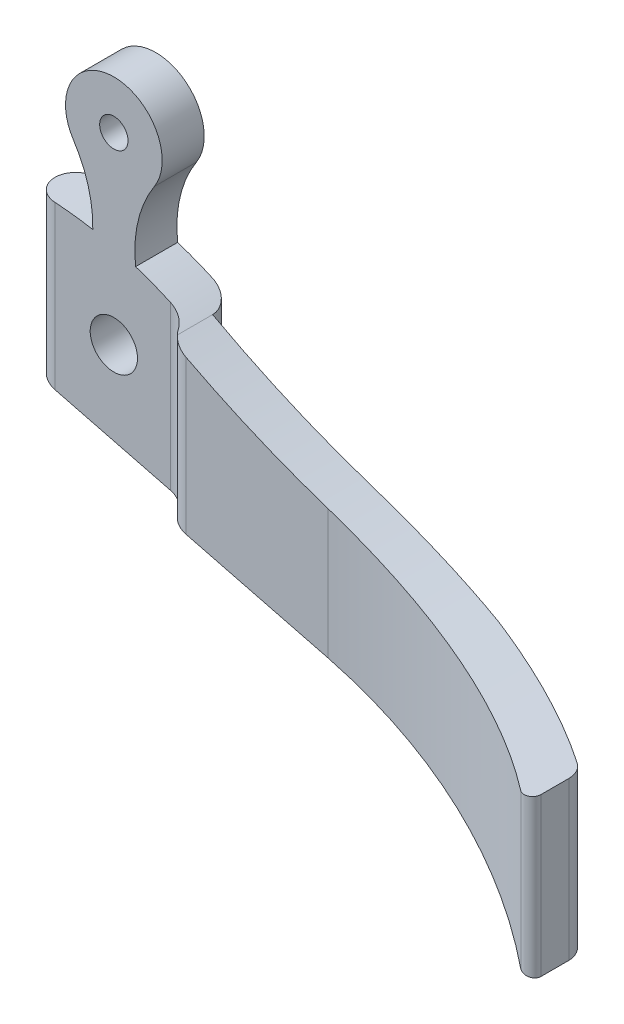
ISO-10303-21;
HEADER;
FILE_DESCRIPTION(('STEP AP214'),'2;1');
FILE_NAME('part.step','',(''),(''),'','','');
FILE_SCHEMA(('AUTOMOTIVE_DESIGN { 1 0 10303 214 1 1 1 1 }'));
ENDSEC;
DATA;
#1=APPLICATION_CONTEXT('core data for automotive mechanical design processes');
#2=APPLICATION_PROTOCOL_DEFINITION('international standard','automotive_design',2000,#1);
#3=PRODUCT_CONTEXT('',#1,'mechanical');
#4=PRODUCT('Part','Part','',(#3));
#5=PRODUCT_RELATED_PRODUCT_CATEGORY('part','',(#4));
#6=PRODUCT_DEFINITION_FORMATION('','',#4);
#7=PRODUCT_DEFINITION_CONTEXT('part definition',#1,'design');
#8=PRODUCT_DEFINITION('design','',#6,#7);
#9=PRODUCT_DEFINITION_SHAPE('','',#8);
#10=(LENGTH_UNIT() NAMED_UNIT(*) SI_UNIT(.MILLI.,.METRE.));
#11=(NAMED_UNIT(*) PLANE_ANGLE_UNIT() SI_UNIT($,.RADIAN.));
#12=(NAMED_UNIT(*) SI_UNIT($,.STERADIAN.) SOLID_ANGLE_UNIT());
#13=UNCERTAINTY_MEASURE_WITH_UNIT(LENGTH_MEASURE(1.E-05),#10,'distance_accuracy_value','');
#14=(GEOMETRIC_REPRESENTATION_CONTEXT(3) GLOBAL_UNCERTAINTY_ASSIGNED_CONTEXT((#13)) GLOBAL_UNIT_ASSIGNED_CONTEXT((#10,
#11,#12)) REPRESENTATION_CONTEXT('',''));
#15=CARTESIAN_POINT('',(0.,0.,0.));
#16=DIRECTION('',(0.,0.,1.));
#17=DIRECTION('',(1.,0.,0.));
#18=AXIS2_PLACEMENT_3D('',#15,#16,#17);
#19=CARTESIAN_POINT('',(0.,19.05,17.5519263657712));
#20=DIRECTION('',(0.246398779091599,0.969168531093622,0.));
#21=DIRECTION('',(-0.969168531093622,0.246398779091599,0.));
#22=AXIS2_PLACEMENT_3D('',#19,#20,#21);
#23=PLANE('',#22);
#24=CARTESIAN_POINT('',(37.9327961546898,9.40606877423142,60.9597607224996));
#25=DIRECTION('',(0.246398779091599,0.969168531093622,0.));
#26=DIRECTION('',(0.969168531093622,-0.246398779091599,0.));
#27=AXIS2_PLACEMENT_3D('',#24,#25,#26);
#28=ELLIPSE('',#27,65.8701395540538,63.8392663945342);
#29=CARTESIAN_POINT('',(73.81777072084,0.282770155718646,8.16089203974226));
#30=VERTEX_POINT('',#29);
#31=CARTESIAN_POINT('',(55.88,4.84322033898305,-0.304827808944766));
#32=VERTEX_POINT('',#31);
#33=EDGE_CURVE('E171',#30,#32,#28,.T.);
#34=ORIENTED_EDGE('',*,*,#33,.F.);
#35=CARTESIAN_POINT('',(72.39,0.645762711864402,10.2616230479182));
#36=DIRECTION('',(0.246398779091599,0.969168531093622,0.));
#37=DIRECTION('',(0.969168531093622,-0.246398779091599,0.));
#38=AXIS2_PLACEMENT_3D('',#35,#36,#37);
#39=ELLIPSE('',#38,2.62080321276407,2.54);
#40=CARTESIAN_POINT('',(74.93,0.,10.2616230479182));
#41=VERTEX_POINT('',#40);
#42=EDGE_CURVE('E60',#30,#41,#39,.F.);
#43=ORIENTED_EDGE('',*,*,#42,.T.);
#44=DIRECTION('',(0.,0.,1.));
#45=VECTOR('',#44,1.);
#46=CARTESIAN_POINT('',(74.93,0.,10.16));
#47=LINE('',#46,#45);
#48=CARTESIAN_POINT('',(74.93,0.,13.6523504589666));
#49=VERTEX_POINT('',#48);
#50=EDGE_CURVE('E190',#41,#49,#47,.T.);
#51=ORIENTED_EDGE('',*,*,#50,.T.);
#52=CARTESIAN_POINT('',(73.914,0.258305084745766,13.6523504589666));
#53=DIRECTION('',(-0.246398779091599,-0.969168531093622,0.));
#54=DIRECTION('',(0.969168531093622,-0.246398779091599,0.));
#55=AXIS2_PLACEMENT_3D('',#52,#53,#54);
#56=ELLIPSE('',#55,1.04832128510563,1.016);
#57=CARTESIAN_POINT('',(73.2989366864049,0.414677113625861,14.4610241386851));
#58=VERTEX_POINT('',#57);
#59=EDGE_CURVE('E453',#58,#49,#56,.F.);
#60=ORIENTED_EDGE('',*,*,#59,.F.);
#61=CARTESIAN_POINT('',(37.9327961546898,9.40606877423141,60.9597607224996));
#62=DIRECTION('',(-0.246398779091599,-0.969168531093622,0.));
#63=DIRECTION('',(0.969168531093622,-0.246398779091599,0.));
#64=AXIS2_PLACEMENT_3D('',#61,#62,#63);
#65=ELLIPSE('',#64,60.2784738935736,58.42);
#66=CARTESIAN_POINT('',(38.1,9.36355932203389,2.54));
#67=VERTEX_POINT('',#66);
#68=EDGE_CURVE('E201',#58,#67,#65,.F.);
#69=ORIENTED_EDGE('',*,*,#68,.T.);
#70=DIRECTION('',(-0.969168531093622,0.246398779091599,0.));
#71=VECTOR('',#70,1.);
#72=CARTESIAN_POINT('',(13.3440137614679,15.6574541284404,2.54));
#73=LINE('',#72,#71);
#74=CARTESIAN_POINT('',(20.909409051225,13.7340485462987,2.54));
#75=VERTEX_POINT('',#74);
#76=EDGE_CURVE('E196',#67,#75,#73,.T.);
#77=ORIENTED_EDGE('',*,*,#76,.T.);
#78=CARTESIAN_POINT('',(20.909409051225,13.7340485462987,0.));
#79=DIRECTION('',(0.246398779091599,0.969168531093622,0.));
#80=DIRECTION('',(-0.969168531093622,0.246398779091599,0.));
#81=AXIS2_PLACEMENT_3D('',#78,#79,#80);
#82=ELLIPSE('',#81,2.62080321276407,2.54);
#83=CARTESIAN_POINT('',(18.7097045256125,14.2932954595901,1.27));
#84=VERTEX_POINT('',#83);
#85=EDGE_CURVE('E502',#75,#84,#82,.F.);
#86=ORIENTED_EDGE('',*,*,#85,.T.);
#87=CARTESIAN_POINT('',(16.51,14.8525423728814,2.54));
#88=DIRECTION('',(0.246398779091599,0.969168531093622,0.));
#89=DIRECTION('',(-0.969168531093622,0.246398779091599,0.));
#90=AXIS2_PLACEMENT_3D('',#87,#88,#89);
#91=ELLIPSE('',#90,2.62080321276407,2.54);
#92=CARTESIAN_POINT('',(16.51,14.8525423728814,0.));
#93=VERTEX_POINT('',#92);
#94=EDGE_CURVE('E275',#84,#93,#91,.T.);
#95=ORIENTED_EDGE('',*,*,#94,.T.);
#96=DIRECTION('',(0.969168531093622,-0.246398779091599,0.));
#97=VECTOR('',#96,1.);
#98=CARTESIAN_POINT('',(0.,19.05,0.));
#99=LINE('',#98,#97);
#100=CARTESIAN_POINT('',(2.54,18.4042372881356,0.));
#101=VERTEX_POINT('',#100);
#102=EDGE_CURVE('E455',#101,#93,#99,.T.);
#103=ORIENTED_EDGE('',*,*,#102,.F.);
#104=CARTESIAN_POINT('',(2.54,18.4042372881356,-2.54));
#105=DIRECTION('',(0.246398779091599,0.969168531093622,0.));
#106=DIRECTION('',(0.969168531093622,-0.246398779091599,0.));
#107=AXIS2_PLACEMENT_3D('',#104,#105,#106);
#108=ELLIPSE('',#107,2.62080321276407,2.54);
#109=CARTESIAN_POINT('',(0.,19.05,-2.54));
#110=VERTEX_POINT('',#109);
#111=EDGE_CURVE('E497',#101,#110,#108,.F.);
#112=ORIENTED_EDGE('',*,*,#111,.T.);
#113=CARTESIAN_POINT('',(2.54,18.4042372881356,-2.54));
#114=DIRECTION('',(-0.246398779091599,-0.969168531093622,0.));
#115=DIRECTION('',(0.969168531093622,-0.246398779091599,0.));
#116=AXIS2_PLACEMENT_3D('',#113,#114,#115);
#117=ELLIPSE('',#116,2.62080321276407,2.54);
#118=CARTESIAN_POINT('',(2.54,18.4042372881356,-5.08));
#119=VERTEX_POINT('',#118);
#120=EDGE_CURVE('E462',#110,#119,#117,.T.);
#121=ORIENTED_EDGE('',*,*,#120,.T.);
#122=DIRECTION('',(-0.969168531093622,0.246398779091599,0.));
#123=VECTOR('',#122,1.);
#124=CARTESIAN_POINT('',(0.,19.05,-5.08));
#125=LINE('',#124,#123);
#126=CARTESIAN_POINT('',(16.51,14.8525423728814,-5.08));
#127=VERTEX_POINT('',#126);
#128=EDGE_CURVE('E454',#127,#119,#125,.T.);
#129=ORIENTED_EDGE('',*,*,#128,.F.);
#130=CARTESIAN_POINT('',(16.5099999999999,14.8525423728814,-2.53999999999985));
#131=DIRECTION('',(-0.246398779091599,-0.969168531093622,0.));
#132=DIRECTION('',(0.969168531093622,-0.246398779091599,0.));
#133=AXIS2_PLACEMENT_3D('',#130,#131,#132);
#134=ELLIPSE('',#133,2.62080321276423,2.54000000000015);
#135=CARTESIAN_POINT('',(19.05,14.206779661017,-2.54000000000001));
#136=VERTEX_POINT('',#135);
#137=EDGE_CURVE('E460',#127,#136,#134,.T.);
#138=ORIENTED_EDGE('',*,*,#137,.T.);
#139=DIRECTION('',(0.969168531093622,-0.246398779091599,0.));
#140=VECTOR('',#139,1.);
#141=CARTESIAN_POINT('',(13.3442525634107,15.657393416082,-2.54));
#142=LINE('',#141,#140);
#143=CARTESIAN_POINT('',(38.1,9.3635593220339,-2.54));
#144=VERTEX_POINT('',#143);
#145=EDGE_CURVE('E195',#136,#144,#142,.T.);
#146=ORIENTED_EDGE('',*,*,#145,.T.);
#147=CARTESIAN_POINT('',(38.1,9.3635593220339,69.294375));
#148=DIRECTION('',(-0.246398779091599,-0.969168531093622,0.));
#149=DIRECTION('',(0.969168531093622,-0.246398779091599,0.));
#150=AXIS2_PLACEMENT_3D('',#147,#148,#149);
#151=ELLIPSE('',#150,74.1195908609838,71.834375);
#152=EDGE_CURVE('E186',#144,#32,#151,.T.);
#153=ORIENTED_EDGE('',*,*,#152,.T.);
#154=EDGE_LOOP('',(#34,#43,#51,#60,#69,#77,#86,#95,#103,#112,#121,#129,#138,#146,#153));
#155=FACE_BOUND('',#154,.T.);
#156=ADVANCED_FACE('F33',(#155),#23,.F.);
#157=CARTESIAN_POINT('',(74.93,38.1,10.16));
#158=DIRECTION('',(-1.,0.,0.));
#159=DIRECTION('',(0.,0.,-1.));
#160=AXIS2_PLACEMENT_3D('',#157,#158,#159);
#161=PLANE('',#160);
#162=ORIENTED_EDGE('',*,*,#50,.F.);
#163=DIRECTION('',(0.,1.,0.));
#164=VECTOR('',#163,1.);
#165=CARTESIAN_POINT('',(74.93,19.05,10.2616230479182));
#166=LINE('',#165,#164);
#167=CARTESIAN_POINT('',(74.93,19.05,10.2616230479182));
#168=VERTEX_POINT('',#167);
#169=EDGE_CURVE('E46',#41,#168,#166,.T.);
#170=ORIENTED_EDGE('',*,*,#169,.T.);
#171=DIRECTION('',(0.,0.,-1.));
#172=VECTOR('',#171,1.);
#173=CARTESIAN_POINT('',(74.93,19.05,10.16));
#174=LINE('',#173,#172);
#175=CARTESIAN_POINT('',(74.93,19.05,13.6523504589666));
#176=VERTEX_POINT('',#175);
#177=EDGE_CURVE('E358',#176,#168,#174,.T.);
#178=ORIENTED_EDGE('',*,*,#177,.F.);
#179=DIRECTION('',(0.,-1.,0.));
#180=VECTOR('',#179,1.);
#181=CARTESIAN_POINT('',(74.93,38.1,13.6523504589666));
#182=LINE('',#181,#180);
#183=EDGE_CURVE('E387',#49,#176,#182,.F.);
#184=ORIENTED_EDGE('',*,*,#183,.F.);
#185=EDGE_LOOP('',(#162,#170,#178,#184));
#186=FACE_BOUND('',#185,.T.);
#187=ADVANCED_FACE('F336',(#186),#161,.F.);
#188=CARTESIAN_POINT('',(74.93,136.050723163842,10.16));
#189=DIRECTION('',(0.,0.,-1.));
#190=DIRECTION('',(1.,0.,0.));
#191=AXIS2_PLACEMENT_3D('',#188,#189,#190);
#192=CYLINDRICAL_SURFACE('',#191,117.000723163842);
#193=ORIENTED_EDGE('',*,*,#177,.T.);
#194=CARTESIAN_POINT('',(74.93,19.05,10.2616230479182));
#195=CARTESIAN_POINT('',(74.930006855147,19.0500004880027,10.1901645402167));
#196=CARTESIAN_POINT('',(74.9269844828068,19.0500000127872,10.1187092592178));
#197=CARTESIAN_POINT('',(74.9149342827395,19.0500006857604,9.97630978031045));
#198=CARTESIAN_POINT('',(74.9059067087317,19.0500018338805,9.9053655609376));
#199=CARTESIAN_POINT('',(74.8819140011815,19.0500092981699,9.76457417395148));
#200=CARTESIAN_POINT('',(74.8669562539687,19.0500156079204,9.69472575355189));
#201=CARTESIAN_POINT('',(74.8312245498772,19.0500403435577,9.55655431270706));
#202=CARTESIAN_POINT('',(74.8104507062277,19.0500587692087,9.48823126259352));
#203=CARTESIAN_POINT('',(74.7395585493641,19.0501452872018,9.28616841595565));
#204=CARTESIAN_POINT('',(74.6808670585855,19.0502446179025,9.15532002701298));
#205=CARTESIAN_POINT('',(74.5423943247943,19.0506216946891,8.90544190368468));
#206=CARTESIAN_POINT('',(74.4626188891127,19.0508993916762,8.7864089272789));
#207=CARTESIAN_POINT('',(74.2943160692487,19.0517002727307,8.57603765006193));
#208=CARTESIAN_POINT('',(74.2078031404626,19.052192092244,8.48308958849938));
#209=CARTESIAN_POINT('',(74.0684294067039,19.0531630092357,8.35413836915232));
#210=CARTESIAN_POINT('',(74.0203391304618,19.0535257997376,8.31287823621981));
#211=CARTESIAN_POINT('',(73.9212067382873,19.0543385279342,8.23405955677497));
#212=CARTESIAN_POINT('',(73.8701642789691,19.054788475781,8.19650144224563));
#213=CARTESIAN_POINT('',(73.81777072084,19.0552866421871,8.16089203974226));
#214=B_SPLINE_CURVE_WITH_KNOTS('',3,(#194,#195,#196,#197,#198,#199,#200,#201,#202,#203,#204,
#205,#206,#207,#208,#209,#210,#211,#212,#213),.UNSPECIFIED.,.F.,.F.,(4,2,2,2,2,2,2,2,2,4),(0.,
0.214305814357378,0.428602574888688,0.642633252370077,0.856659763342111,1.28466801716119,
1.71255850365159,2.09198828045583,2.28193051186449,2.4718948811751),.UNSPECIFIED.);
#215=CARTESIAN_POINT('',(73.81777072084,19.0552866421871,8.16089203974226));
#216=VERTEX_POINT('',#215);
#217=EDGE_CURVE('E12',#168,#216,#214,.T.);
#218=ORIENTED_EDGE('',*,*,#217,.T.);
#219=CARTESIAN_POINT('',(74.93,19.05,8.93420122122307));
#220=CARTESIAN_POINT('',(74.2020518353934,19.0499871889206,8.41650692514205));
#221=CARTESIAN_POINT('',(73.4631995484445,19.0567931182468,7.9141124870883));
#222=CARTESIAN_POINT('',(71.9652416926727,19.0851734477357,6.94085934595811));
#223=CARTESIAN_POINT('',(71.2061352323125,19.1067484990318,6.47000203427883));
#224=CARTESIAN_POINT('',(69.6757435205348,19.1655502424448,5.56462378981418));
#225=CARTESIAN_POINT('',(68.9046141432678,19.2026439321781,5.12983084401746));
#226=CARTESIAN_POINT('',(67.3457203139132,19.2934645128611,4.2930655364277));
#227=CARTESIAN_POINT('',(66.5579561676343,19.3471910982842,3.89109257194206));
#228=CARTESIAN_POINT('',(64.9674836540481,19.472192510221,3.12068714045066));
#229=CARTESIAN_POINT('',(64.1647742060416,19.5434686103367,2.7522571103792));
#230=CARTESIAN_POINT('',(62.5463152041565,19.7043652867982,2.0496176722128));
#231=CARTESIAN_POINT('',(61.7305655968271,19.793985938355,1.71540840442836));
#232=CARTESIAN_POINT('',(60.0810041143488,19.9930990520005,1.07907391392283));
#233=CARTESIAN_POINT('',(59.2470978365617,20.102753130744,0.777243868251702));
#234=CARTESIAN_POINT('',(57.5699980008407,20.341957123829,0.20931228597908));
#235=CARTESIAN_POINT('',(56.7268041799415,20.4715076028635,-0.0567882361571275));
#236=CARTESIAN_POINT('',(55.88,20.6112727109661,-0.304827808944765));
#237=B_SPLINE_CURVE_WITH_KNOTS('',3,(#219,#220,#221,#222,#223,#224,#225,#226,#227,#228,#229,
#230,#231,#232,#233,#234,#235,#236),.UNSPECIFIED.,.F.,.F.,(4,2,2,2,2,2,2,2,4),(0.,
2.67959027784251,5.35929869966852,8.01649652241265,10.6736455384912,13.3309874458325,
15.988340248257,18.6681620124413,21.3480598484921),.UNSPECIFIED.);
#238=CARTESIAN_POINT('',(55.88,20.6112727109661,-0.304827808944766));
#239=VERTEX_POINT('',#238);
#240=EDGE_CURVE('E300',#216,#239,#237,.T.);
#241=ORIENTED_EDGE('',*,*,#240,.T.);
#242=CARTESIAN_POINT('',(38.1,24.9979414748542,-2.54));
#243=CARTESIAN_POINT('',(38.8341376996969,24.7544574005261,-2.54000917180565));
#244=CARTESIAN_POINT('',(39.5707086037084,24.5182697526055,-2.52874604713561));
#245=CARTESIAN_POINT('',(41.0477625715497,24.0607222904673,-2.48329378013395));
#246=CARTESIAN_POINT('',(41.7882457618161,23.8393629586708,-2.44910389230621));
#247=CARTESIAN_POINT('',(43.2681800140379,23.4128590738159,-2.35766020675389));
#248=CARTESIAN_POINT('',(44.00761565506,23.2076346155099,-2.30052992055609));
#249=CARTESIAN_POINT('',(45.4883390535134,22.8122801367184,-2.16290396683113));
#250=CARTESIAN_POINT('',(46.2296267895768,22.6221499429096,-2.08240856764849));
#251=CARTESIAN_POINT('',(47.7130450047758,22.2570939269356,-1.89779781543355));
#252=CARTESIAN_POINT('',(48.4551755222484,22.082168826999,-1.79368134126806));
#253=CARTESIAN_POINT('',(49.9391616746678,21.7475919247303,-1.56164610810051));
#254=CARTESIAN_POINT('',(50.6810173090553,21.587940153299,-1.43372730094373));
#255=CARTESIAN_POINT('',(52.1673001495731,21.2831011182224,-1.15321790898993));
#256=CARTESIAN_POINT('',(52.9117199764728,21.1379955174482,-1.00049941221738));
#257=CARTESIAN_POINT('',(54.398038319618,20.863138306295,-0.670839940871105));
#258=CARTESIAN_POINT('',(55.1399367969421,20.7333869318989,-0.4938985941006));
#259=CARTESIAN_POINT('',(55.88,20.6112727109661,-0.304827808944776));
#260=B_SPLINE_CURVE_WITH_KNOTS('',3,(#242,#243,#244,#245,#246,#247,#248,#249,#250,#251,#252,
#253,#254,#255,#256,#257,#258,#259),.UNSPECIFIED.,.F.,.F.,(4,2,2,2,2,2,2,2,4),(0.,
2.32028298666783,4.64064142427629,6.94867101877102,9.25667410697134,11.5647867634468,
13.8729040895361,16.1933281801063,18.5137879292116),.UNSPECIFIED.);
#261=CARTESIAN_POINT('',(38.1,24.9979414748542,-2.54));
#262=VERTEX_POINT('',#261);
#263=EDGE_CURVE('E189',#262,#239,#260,.T.);
#264=ORIENTED_EDGE('',*,*,#263,.F.);
#265=CARTESIAN_POINT('',(74.93,136.050723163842,-2.54));
#266=DIRECTION('',(0.,0.,-1.));
#267=DIRECTION('',(-1.,0.,0.));
#268=AXIS2_PLACEMENT_3D('',#265,#266,#267);
#269=CIRCLE('',#268,117.000723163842);
#270=CARTESIAN_POINT('',(19.05,33.2567796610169,-2.54));
#271=VERTEX_POINT('',#270);
#272=EDGE_CURVE('E356',#271,#262,#269,.F.);
#273=ORIENTED_EDGE('',*,*,#272,.F.);
#274=DIRECTION('',(0.,0.,-1.));
#275=VECTOR('',#274,1.);
#276=CARTESIAN_POINT('',(19.05,33.2567796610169,10.16));
#277=LINE('',#276,#275);
#278=CARTESIAN_POINT('',(19.05,33.2567796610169,1.73037509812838));
#279=VERTEX_POINT('',#278);
#280=EDGE_CURVE('E357',#279,#271,#277,.T.);
#281=ORIENTED_EDGE('',*,*,#280,.F.);
#282=CARTESIAN_POINT('',(19.05,33.2567796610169,1.73037509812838));
#283=CARTESIAN_POINT('',(19.103011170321,33.2279619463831,1.78733454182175));
#284=CARTESIAN_POINT('',(19.1582933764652,33.1979633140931,1.8414938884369));
#285=CARTESIAN_POINT('',(19.272863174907,33.1359206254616,1.944024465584));
#286=CARTESIAN_POINT('',(19.332148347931,33.1038778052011,1.99239914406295));
#287=CARTESIAN_POINT('',(19.5149878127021,33.0052734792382,2.1284268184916));
#288=CARTESIAN_POINT('',(19.6438056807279,32.9360838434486,2.20727979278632));
#289=CARTESIAN_POINT('',(19.9107956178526,32.7933781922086,2.34021645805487));
#290=CARTESIAN_POINT('',(20.0489471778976,32.7198717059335,2.39435255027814));
#291=CARTESIAN_POINT('',(20.3312609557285,32.5704239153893,2.47769029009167));
#292=CARTESIAN_POINT('',(20.4754180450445,32.4944847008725,2.50691277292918));
#293=CARTESIAN_POINT('',(20.6686731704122,32.3932072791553,2.52902857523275));
#294=CARTESIAN_POINT('',(20.7167701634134,32.3680442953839,2.53314508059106));
#295=CARTESIAN_POINT('',(20.8130361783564,32.3177661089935,2.53862701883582));
#296=CARTESIAN_POINT('',(20.8612049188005,32.2926509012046,2.53999734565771));
#297=CARTESIAN_POINT('',(20.909409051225,32.2675599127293,2.54));
#298=B_SPLINE_CURVE_WITH_KNOTS('',3,(#282,#283,#284,#285,#286,#287,#288,#289,#290,#291,#292,
#293,#294,#295,#296,#297),.UNSPECIFIED.,.F.,.F.,(4,2,2,2,2,2,2,4),(0.,0.248732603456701,
0.497316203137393,0.993196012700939,1.48801958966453,1.98242893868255,2.1456924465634,
2.3086647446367),.UNSPECIFIED.);
#299=CARTESIAN_POINT('',(20.909409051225,32.2675599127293,2.54));
#300=VERTEX_POINT('',#299);
#301=EDGE_CURVE('E295',#279,#300,#298,.T.);
#302=ORIENTED_EDGE('',*,*,#301,.T.);
#303=CARTESIAN_POINT('',(74.93,136.050723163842,2.54));
#304=DIRECTION('',(0.,0.,1.));
#305=DIRECTION('',(1.,0.,0.));
#306=AXIS2_PLACEMENT_3D('',#303,#304,#305);
#307=CIRCLE('',#306,117.000723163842);
#308=CARTESIAN_POINT('',(38.1,24.9979414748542,2.54));
#309=VERTEX_POINT('',#308);
#310=EDGE_CURVE('E205',#309,#300,#307,.F.);
#311=ORIENTED_EDGE('',*,*,#310,.F.);
#312=CARTESIAN_POINT('',(74.93,19.05,15.748));
#313=CARTESIAN_POINT('',(74.3415561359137,19.0499940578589,15.2664553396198));
#314=CARTESIAN_POINT('',(73.7436882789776,19.0544390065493,14.7964110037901));
#315=CARTESIAN_POINT('',(72.5301439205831,19.0730423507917,13.8800658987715));
#316=CARTESIAN_POINT('',(71.9144668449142,19.0872010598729,13.4337658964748));
#317=CARTESIAN_POINT('',(70.6662483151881,19.1260478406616,12.5655909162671));
#318=CARTESIAN_POINT('',(70.0337032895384,19.1507381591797,12.143721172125));
#319=CARTESIAN_POINT('',(68.7530235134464,19.2114100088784,11.325221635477));
#320=CARTESIAN_POINT('',(68.104888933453,19.2473914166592,10.928591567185));
#321=CARTESIAN_POINT('',(66.7940351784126,19.3313727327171,10.1611161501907));
#322=CARTESIAN_POINT('',(66.131311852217,19.379376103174,9.79027826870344));
#323=CARTESIAN_POINT('',(64.792664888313,19.4880591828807,9.07508312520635));
#324=CARTESIAN_POINT('',(64.1167400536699,19.5487400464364,8.73072827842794));
#325=CARTESIAN_POINT('',(62.7532239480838,19.6833542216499,8.06914862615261));
#326=CARTESIAN_POINT('',(62.0656353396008,19.7572845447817,7.75191772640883));
#327=CARTESIAN_POINT('',(60.6799508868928,19.9189362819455,7.1449342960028));
#328=CARTESIAN_POINT('',(59.9818540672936,20.006658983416,6.85518433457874));
#329=CARTESIAN_POINT('',(58.5753864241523,20.1965033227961,6.30309044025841));
#330=CARTESIAN_POINT('',(57.866999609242,20.2986501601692,6.04079589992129));
#331=CARTESIAN_POINT('',(56.442553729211,20.5175985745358,5.54447220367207));
#332=CARTESIAN_POINT('',(55.7264939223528,20.6344015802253,5.31044580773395));
#333=CARTESIAN_POINT('',(54.2881795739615,20.882945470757,4.87087333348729));
#334=CARTESIAN_POINT('',(53.5659245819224,21.0146874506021,4.66532934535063));
#335=CARTESIAN_POINT('',(52.11675106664,21.2932844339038,4.2828366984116));
#336=CARTESIAN_POINT('',(51.3898321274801,21.4401408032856,4.10589062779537));
#337=CARTESIAN_POINT('',(49.2075732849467,21.9028723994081,3.61873760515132));
#338=CARTESIAN_POINT('',(47.7472694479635,22.2415046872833,3.35116190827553));
#339=CARTESIAN_POINT('',(44.8264276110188,22.9790116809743,2.92915841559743));
#340=CARTESIAN_POINT('',(43.3658901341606,23.377854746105,2.77467143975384));
#341=CARTESIAN_POINT('',(41.2726539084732,23.9936155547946,2.63179946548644));
#342=CARTESIAN_POINT('',(40.6357150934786,24.1869002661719,2.59885620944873));
#343=CARTESIAN_POINT('',(39.682729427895,24.4850040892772,2.56511227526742));
#344=CARTESIAN_POINT('',(39.3656588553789,24.5856726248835,2.55647660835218));
#345=CARTESIAN_POINT('',(38.7322451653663,24.7897571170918,2.54437173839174));
#346=CARTESIAN_POINT('',(38.4159021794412,24.8931735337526,2.54090340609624));
#347=CARTESIAN_POINT('',(38.1,24.9979414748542,2.54000000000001));
#348=B_SPLINE_CURVE_WITH_KNOTS('',3,(#312,#313,#314,#315,#316,#317,#318,#319,#320,#321,#322,
#323,#324,#325,#326,#327,#328,#329,#330,#331,#332,#333,#334,#335,#336,#337,#338,#339,#340,#341,
#342,#343,#344,#345,#346,#347),.UNSPECIFIED.,.F.,.F.,(4,2,2,2,2,2,2,2,2,2,2,2,2,2,2,2,2,4),(0.,
2.28094505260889,4.56196373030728,6.84346928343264,9.12494990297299,11.4070883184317,
13.6894346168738,15.9712667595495,18.253312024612,20.5393945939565,22.8257001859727,
25.1121734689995,27.3988535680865,31.9612483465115,36.5212538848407,38.5201999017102,
39.5184880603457,40.5169444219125),.UNSPECIFIED.);
#349=CARTESIAN_POINT('',(73.2989366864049,19.0613695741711,14.4610241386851));
#350=VERTEX_POINT('',#349);
#351=EDGE_CURVE('E198',#350,#309,#348,.T.);
#352=ORIENTED_EDGE('',*,*,#351,.F.);
#353=CARTESIAN_POINT('',(74.93,19.05,13.6523504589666));
#354=CARTESIAN_POINT('',(74.9299998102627,19.0500000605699,13.6809346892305));
#355=CARTESIAN_POINT('',(74.928792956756,19.049999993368,13.7095052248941));
#356=CARTESIAN_POINT('',(74.9239783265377,19.0500001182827,13.7664418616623));
#357=CARTESIAN_POINT('',(74.9203706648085,19.050000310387,13.7948079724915));
#358=CARTESIAN_POINT('',(74.9059802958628,19.0500020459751,13.8792478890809));
#359=CARTESIAN_POINT('',(74.8916301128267,19.0500047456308,13.9347560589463));
#360=CARTESIAN_POINT('',(74.8538149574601,19.0500232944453,14.0425728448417));
#361=CARTESIAN_POINT('',(74.8303457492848,19.0500391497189,14.094879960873));
#362=CARTESIAN_POINT('',(74.7749617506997,19.050099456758,14.1948093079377));
#363=CARTESIAN_POINT('',(74.7430485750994,19.0501439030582,14.2424324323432));
#364=CARTESIAN_POINT('',(74.6716803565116,19.0502797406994,14.3316444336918));
#365=CARTESIAN_POINT('',(74.6322251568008,19.050371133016,14.3732331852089));
#366=CARTESIAN_POINT('',(74.5468869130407,19.0506194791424,14.4492029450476));
#367=CARTESIAN_POINT('',(74.5010029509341,19.0507764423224,14.4835829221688));
#368=CARTESIAN_POINT('',(74.4041170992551,19.0511718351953,14.5441491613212));
#369=CARTESIAN_POINT('',(74.3531154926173,19.0514102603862,14.5703358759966));
#370=CARTESIAN_POINT('',(74.2474432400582,19.0519790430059,14.6137737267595));
#371=CARTESIAN_POINT('',(74.192772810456,19.052309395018,14.6310253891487));
#372=CARTESIAN_POINT('',(74.0813143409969,19.0530648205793,14.6561059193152));
#373=CARTESIAN_POINT('',(74.0245263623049,19.0534898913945,14.6639350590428));
#374=CARTESIAN_POINT('',(73.9104348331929,19.054428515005,14.6699487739));
#375=CARTESIAN_POINT('',(73.8531312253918,19.0549420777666,14.6681322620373));
#376=CARTESIAN_POINT('',(73.7396291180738,19.056041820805,14.654906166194));
#377=CARTESIAN_POINT('',(73.6834310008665,19.0566280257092,14.6434933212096));
#378=CARTESIAN_POINT('',(73.57376828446,19.0578479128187,14.611389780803));
#379=CARTESIAN_POINT('',(73.5203017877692,19.0584815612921,14.5907056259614));
#380=CARTESIAN_POINT('',(73.4389854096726,19.0594969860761,14.5510907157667));
#381=CARTESIAN_POINT('',(73.4097184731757,19.0598740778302,14.5349992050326));
#382=CARTESIAN_POINT('',(73.3529544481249,19.0606254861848,14.5000491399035));
#383=CARTESIAN_POINT('',(73.3254544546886,19.0609998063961,14.4811953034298));
#384=CARTESIAN_POINT('',(73.2989366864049,19.0613695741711,14.4610241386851));
#385=B_SPLINE_CURVE_WITH_KNOTS('',3,(#353,#354,#355,#356,#357,#358,#359,#360,#361,#362,#363,
#364,#365,#366,#367,#368,#369,#370,#371,#372,#373,#374,#375,#376,#377,#378,#379,#380,#381,#382,
#383,#384),.UNSPECIFIED.,.F.,.F.,(4,2,2,2,2,2,2,2,2,2,2,2,2,2,2,4),(0.,0.0857000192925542,
0.17139593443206,0.342512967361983,0.51370958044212,0.684873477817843,0.856040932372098,
1.02723285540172,1.19841531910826,1.36958769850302,1.54075513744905,1.71194186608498,
1.88318679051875,2.0543110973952,2.15436802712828,2.25425601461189),.UNSPECIFIED.);
#386=EDGE_CURVE('E390',#176,#350,#385,.T.);
#387=ORIENTED_EDGE('',*,*,#386,.F.);
#388=EDGE_LOOP('',(#193,#218,#241,#264,#273,#281,#302,#311,#352,#387));
#389=FACE_BOUND('',#388,.T.);
#390=ADVANCED_FACE('F216',(#389),#192,.F.);
#391=CARTESIAN_POINT('',(0.,-1.78661016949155,10.16));
#392=DIRECTION('',(0.,0.,-1.));
#393=DIRECTION('',(1.,0.,0.));
#394=AXIS2_PLACEMENT_3D('',#391,#392,#393);
#395=CYLINDRICAL_SURFACE('',#394,39.8866101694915);
#396=CARTESIAN_POINT('',(16.51,34.5226389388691,0.));
#397=CARTESIAN_POINT('',(16.6666824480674,34.4514414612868,-3.9040781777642E-05));
#398=CARTESIAN_POINT('',(16.8228488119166,34.3791626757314,0.0144943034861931));
#399=CARTESIAN_POINT('',(17.1301922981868,34.2345803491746,0.0719264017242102));
#400=CARTESIAN_POINT('',(17.2813606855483,34.1622769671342,0.11487231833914));
#401=CARTESIAN_POINT('',(17.574308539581,34.0199833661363,0.228386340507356));
#402=CARTESIAN_POINT('',(17.7160810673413,33.949994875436,0.298974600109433));
#403=CARTESIAN_POINT('',(17.9857034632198,33.8150582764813,0.46658085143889));
#404=CARTESIAN_POINT('',(18.1135612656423,33.7501073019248,0.563583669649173));
#405=CARTESIAN_POINT('',(18.3463125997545,33.6304904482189,0.778274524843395));
#406=CARTESIAN_POINT('',(18.4518818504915,33.5755325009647,0.895062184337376));
#407=CARTESIAN_POINT('',(18.6412065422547,33.4760974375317,1.14909345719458));
#408=CARTESIAN_POINT('',(18.7249720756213,33.43161547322,1.28632756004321));
#409=CARTESIAN_POINT('',(18.8583785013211,33.3603438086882,1.56150949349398));
#410=CARTESIAN_POINT('',(18.9107388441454,33.3321566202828,1.69775851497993));
#411=CARTESIAN_POINT('',(18.9713222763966,33.2994426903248,1.90845086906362));
#412=CARTESIAN_POINT('',(18.9885192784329,33.2901350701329,1.97969299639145));
#413=CARTESIAN_POINT('',(19.0167281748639,33.2748499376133,2.12372733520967));
#414=CARTESIAN_POINT('',(19.0277441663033,33.2688702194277,2.19651848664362));
#415=CARTESIAN_POINT('',(19.0403813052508,33.2620071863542,2.31459002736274));
#416=CARTESIAN_POINT('',(19.0439886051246,33.2600470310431,2.35960850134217));
#417=CARTESIAN_POINT('',(19.0487968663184,33.2574337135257,2.44974862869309));
#418=CARTESIAN_POINT('',(19.0500011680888,33.256778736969,2.49487005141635));
#419=CARTESIAN_POINT('',(19.05,33.256779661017,2.54));
#420=B_SPLINE_CURVE_WITH_KNOTS('',3,(#396,#397,#398,#399,#400,#401,#402,#403,#404,#405,#406,
#407,#408,#409,#410,#411,#412,#413,#414,#415,#416,#417,#418,#419),.UNSPECIFIED.,.F.,.F.,(4,2,2,
2,2,2,2,2,2,2,2,4),(0.,0.515671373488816,1.0322008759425,1.54910768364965,2.06571818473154,
2.56317280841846,3.06039676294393,3.50357717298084,3.72491882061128,3.94611357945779,
4.08165442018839,4.21700671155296),.UNSPECIFIED.);
#421=CARTESIAN_POINT('',(16.51,34.5226389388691,0.));
#422=VERTEX_POINT('',#421);
#423=CARTESIAN_POINT('',(18.7097045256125,33.4396389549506,1.27));
#424=VERTEX_POINT('',#423);
#425=EDGE_CURVE('E267',#422,#424,#420,.T.);
#426=ORIENTED_EDGE('',*,*,#425,.T.);
#427=CARTESIAN_POINT('',(18.7097045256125,33.4396389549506,1.27));
#428=CARTESIAN_POINT('',(18.7340045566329,33.426732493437,1.31209277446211));
#429=CARTESIAN_POINT('',(18.7594303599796,33.4131958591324,1.35333771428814));
#430=CARTESIAN_POINT('',(18.8122966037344,33.3849701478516,1.43388615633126));
#431=CARTESIAN_POINT('',(18.8397297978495,33.370285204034,1.4731958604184));
#432=CARTESIAN_POINT('',(18.8965424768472,33.3397815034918,1.54991835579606));
#433=CARTESIAN_POINT('',(18.9259218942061,33.3239627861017,1.58733121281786));
#434=CARTESIAN_POINT('',(18.9865859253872,33.2911950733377,1.66030485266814));
#435=CARTESIAN_POINT('',(19.0178767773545,33.2742423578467,1.69585878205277));
#436=CARTESIAN_POINT('',(19.05,33.2567796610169,1.73037509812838));
#437=B_SPLINE_CURVE_WITH_KNOTS('',3,(#427,#428,#429,#430,#431,#432,#433,#434,#435,#436),
.UNSPECIFIED.,.F.,.F.,(4,2,2,2,4),(0.,0.150834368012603,0.301148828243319,0.451458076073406,
0.602287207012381),.UNSPECIFIED.);
#438=EDGE_CURVE('E289',#424,#279,#437,.T.);
#439=ORIENTED_EDGE('',*,*,#438,.T.);
#440=ORIENTED_EDGE('',*,*,#280,.T.);
#441=CARTESIAN_POINT('',(16.51,34.5226389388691,-5.08));
#442=CARTESIAN_POINT('',(16.6666824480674,34.4514414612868,-5.08003904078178));
#443=CARTESIAN_POINT('',(16.8228488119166,34.3791626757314,-5.06550569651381));
#444=CARTESIAN_POINT('',(17.1301922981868,34.2345803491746,-5.00807359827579));
#445=CARTESIAN_POINT('',(17.2813606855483,34.1622769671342,-4.96512768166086));
#446=CARTESIAN_POINT('',(17.574308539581,34.0199833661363,-4.85161365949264));
#447=CARTESIAN_POINT('',(17.7160810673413,33.949994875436,-4.78102539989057));
#448=CARTESIAN_POINT('',(17.9857034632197,33.8150582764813,-4.61341914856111));
#449=CARTESIAN_POINT('',(18.1135612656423,33.7501073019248,-4.51641633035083));
#450=CARTESIAN_POINT('',(18.3463125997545,33.6304904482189,-4.3017254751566));
#451=CARTESIAN_POINT('',(18.4518818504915,33.5755325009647,-4.18493781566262));
#452=CARTESIAN_POINT('',(18.6412065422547,33.4760974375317,-3.93090654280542));
#453=CARTESIAN_POINT('',(18.7249720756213,33.43161547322,-3.79367243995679));
#454=CARTESIAN_POINT('',(18.8583785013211,33.3603438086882,-3.51849050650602));
#455=CARTESIAN_POINT('',(18.9107388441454,33.3321566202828,-3.38224148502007));
#456=CARTESIAN_POINT('',(18.9713222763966,33.2994426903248,-3.17154913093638));
#457=CARTESIAN_POINT('',(18.9885192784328,33.2901350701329,-3.10030700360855));
#458=CARTESIAN_POINT('',(19.0167281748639,33.2748499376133,-2.95627266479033));
#459=CARTESIAN_POINT('',(19.0277441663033,33.2688702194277,-2.88348151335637));
#460=CARTESIAN_POINT('',(19.0403813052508,33.2620071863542,-2.76540997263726));
#461=CARTESIAN_POINT('',(19.0439886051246,33.2600470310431,-2.72039149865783));
#462=CARTESIAN_POINT('',(19.0487968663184,33.2574337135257,-2.63025137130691));
#463=CARTESIAN_POINT('',(19.0500011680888,33.256778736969,-2.58512994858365));
#464=CARTESIAN_POINT('',(19.05,33.256779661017,-2.54));
#465=B_SPLINE_CURVE_WITH_KNOTS('',3,(#441,#442,#443,#444,#445,#446,#447,#448,#449,#450,#451,
#452,#453,#454,#455,#456,#457,#458,#459,#460,#461,#462,#463,#464),.UNSPECIFIED.,.F.,.F.,(4,2,2,
2,2,2,2,2,2,2,2,4),(0.,0.515671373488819,1.0322008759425,1.54910768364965,2.06571818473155,
2.56317280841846,3.06039676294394,3.50357717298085,3.72491882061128,3.94611357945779,
4.08165442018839,4.21700671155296),.UNSPECIFIED.);
#466=CARTESIAN_POINT('',(16.51,34.5226389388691,-5.08));
#467=VERTEX_POINT('',#466);
#468=EDGE_CURVE('E240',#467,#271,#465,.T.);
#469=ORIENTED_EDGE('',*,*,#468,.F.);
#470=CARTESIAN_POINT('',(0.,-1.78661016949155,-5.08));
#471=DIRECTION('',(0.,0.,-1.));
#472=DIRECTION('',(-1.,0.,0.));
#473=AXIS2_PLACEMENT_3D('',#470,#471,#472);
#474=CIRCLE('',#473,39.8866101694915);
#475=CARTESIAN_POINT('',(12.2819804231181,36.1619685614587,-5.08));
#476=VERTEX_POINT('',#475);
#477=EDGE_CURVE('E360',#476,#467,#474,.T.);
#478=ORIENTED_EDGE('',*,*,#477,.F.);
#479=DIRECTION('',(0.,0.,1.));
#480=VECTOR('',#479,1.);
#481=CARTESIAN_POINT('',(12.2819804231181,36.1619685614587,-2.53999999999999));
#482=LINE('',#481,#480);
#483=CARTESIAN_POINT('',(12.2819804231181,36.1619685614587,0.));
#484=VERTEX_POINT('',#483);
#485=EDGE_CURVE('E435',#484,#476,#482,.F.);
#486=ORIENTED_EDGE('',*,*,#485,.F.);
#487=CARTESIAN_POINT('',(0.,-1.78661016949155,0.));
#488=DIRECTION('',(0.,0.,1.));
#489=DIRECTION('',(1.,0.,0.));
#490=AXIS2_PLACEMENT_3D('',#487,#488,#489);
#491=CIRCLE('',#490,39.8866101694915);
#492=EDGE_CURVE('E191',#422,#484,#491,.T.);
#493=ORIENTED_EDGE('',*,*,#492,.F.);
#494=EDGE_LOOP('',(#426,#439,#440,#469,#478,#486,#493));
#495=FACE_BOUND('',#494,.T.);
#496=ADVANCED_FACE('F236',(#495),#395,.T.);
#497=CARTESIAN_POINT('',(0.,38.1,-5.08));
#498=DIRECTION('',(0.,0.,1.));
#499=DIRECTION('',(-1.,0.,0.));
#500=AXIS2_PLACEMENT_3D('',#497,#498,#499);
#501=PLANE('',#500);
#502=CARTESIAN_POINT('',(9.652,48.8772128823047,-5.08));
#503=DIRECTION('',(0.,0.,1.));
#504=DIRECTION('',(1.,0.,0.));
#505=AXIS2_PLACEMENT_3D('',#502,#503,#504);
#506=CIRCLE('',#505,1.7145);
#507=CARTESIAN_POINT('',(11.3665,48.8772128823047,-5.08));
#508=VERTEX_POINT('',#507);
#509=EDGE_CURVE('E419',#508,#508,#506,.T.);
#510=ORIENTED_EDGE('',*,*,#509,.T.);
#511=EDGE_LOOP('',(#510));
#512=FACE_BOUND('',#511,.T.);
#513=CARTESIAN_POINT('',(9.652,26.67,-5.08));
#514=DIRECTION('',(0.,0.,1.));
#515=DIRECTION('',(1.,0.,0.));
#516=AXIS2_PLACEMENT_3D('',#513,#514,#515);
#517=CIRCLE('',#516,2.8575);
#518=CARTESIAN_POINT('',(12.5095,26.67,-5.08));
#519=VERTEX_POINT('',#518);
#520=EDGE_CURVE('E423',#519,#519,#517,.T.);
#521=ORIENTED_EDGE('',*,*,#520,.T.);
#522=EDGE_LOOP('',(#521));
#523=FACE_BOUND('',#522,.T.);
#524=CARTESIAN_POINT('',(26.67,37.7736064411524,-5.08));
#525=DIRECTION('',(0.,0.,1.));
#526=DIRECTION('',(1.,0.,0.));
#527=AXIS2_PLACEMENT_3D('',#524,#525,#526);
#528=CIRCLE('',#527,14.478);
#529=CARTESIAN_POINT('',(14.544675,45.6849260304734,-5.08));
#530=VERTEX_POINT('',#529);
#531=EDGE_CURVE('E425',#530,#476,#528,.T.);
#532=ORIENTED_EDGE('',*,*,#531,.T.);
#533=ORIENTED_EDGE('',*,*,#477,.T.);
#534=DIRECTION('',(0.,-1.,0.));
#535=VECTOR('',#534,1.);
#536=CARTESIAN_POINT('',(16.51,38.1,-5.08));
#537=LINE('',#536,#535);
#538=EDGE_CURVE('E370',#127,#467,#537,.F.);
#539=ORIENTED_EDGE('',*,*,#538,.F.);
#540=ORIENTED_EDGE('',*,*,#128,.T.);
#541=DIRECTION('',(0.,-1.,0.));
#542=VECTOR('',#541,1.);
#543=CARTESIAN_POINT('',(2.54,38.1,-5.08));
#544=LINE('',#543,#542);
#545=CARTESIAN_POINT('',(2.54,38.0190435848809,-5.08));
#546=VERTEX_POINT('',#545);
#547=EDGE_CURVE('E375',#546,#119,#544,.T.);
#548=ORIENTED_EDGE('',*,*,#547,.F.);
#549=CARTESIAN_POINT('',(7.10863410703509,37.4614342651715,-5.08));
#550=VERTEX_POINT('',#549);
#551=EDGE_CURVE('E361',#546,#550,#474,.T.);
#552=ORIENTED_EDGE('',*,*,#551,.T.);
#553=CARTESIAN_POINT('',(-7.366,37.7736064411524,-5.08));
#554=DIRECTION('',(0.,0.,1.));
#555=DIRECTION('',(1.,0.,0.));
#556=AXIS2_PLACEMENT_3D('',#553,#554,#555);
#557=CIRCLE('',#556,14.478);
#558=CARTESIAN_POINT('',(4.759325,45.6849260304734,-5.08));
#559=VERTEX_POINT('',#558);
#560=EDGE_CURVE('E432',#550,#559,#557,.T.);
#561=ORIENTED_EDGE('',*,*,#560,.T.);
#562=CARTESIAN_POINT('',(9.652,48.8772128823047,-5.08));
#563=DIRECTION('',(0.,0.,1.));
#564=DIRECTION('',(1.,0.,0.));
#565=AXIS2_PLACEMENT_3D('',#562,#563,#564);
#566=CIRCLE('',#565,5.842);
#567=EDGE_CURVE('E429',#559,#530,#566,.F.);
#568=ORIENTED_EDGE('',*,*,#567,.T.);
#569=EDGE_LOOP('',(#532,#533,#539,#540,#548,#552,#561,#568));
#570=FACE_BOUND('',#569,.T.);
#571=ADVANCED_FACE('F408',(#512,#523,#570),#501,.F.);
#572=CARTESIAN_POINT('',(0.,38.1,0.));
#573=DIRECTION('',(0.,0.,-1.));
#574=DIRECTION('',(1.,0.,0.));
#575=AXIS2_PLACEMENT_3D('',#572,#573,#574);
#576=PLANE('',#575);
#577=CARTESIAN_POINT('',(9.652,48.8772128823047,0.));
#578=DIRECTION('',(0.,0.,1.));
#579=DIRECTION('',(1.,0.,0.));
#580=AXIS2_PLACEMENT_3D('',#577,#578,#579);
#581=CIRCLE('',#580,1.7145);
#582=CARTESIAN_POINT('',(11.3665,48.8772128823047,0.));
#583=VERTEX_POINT('',#582);
#584=EDGE_CURVE('E180',#583,#583,#581,.T.);
#585=ORIENTED_EDGE('',*,*,#584,.F.);
#586=EDGE_LOOP('',(#585));
#587=FACE_BOUND('',#586,.T.);
#588=CARTESIAN_POINT('',(9.652,26.67,0.));
#589=DIRECTION('',(0.,0.,1.));
#590=DIRECTION('',(1.,0.,0.));
#591=AXIS2_PLACEMENT_3D('',#588,#589,#590);
#592=CIRCLE('',#591,2.8575);
#593=CARTESIAN_POINT('',(12.5095,26.67,0.));
#594=VERTEX_POINT('',#593);
#595=EDGE_CURVE('E477',#594,#594,#592,.T.);
#596=ORIENTED_EDGE('',*,*,#595,.F.);
#597=EDGE_LOOP('',(#596));
#598=FACE_BOUND('',#597,.T.);
#599=CARTESIAN_POINT('',(7.10863410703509,37.4614342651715,0.));
#600=VERTEX_POINT('',#599);
#601=CARTESIAN_POINT('',(2.54,38.0190435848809,0.));
#602=VERTEX_POINT('',#601);
#603=EDGE_CURVE('E364',#600,#602,#491,.T.);
#604=ORIENTED_EDGE('',*,*,#603,.T.);
#605=DIRECTION('',(0.,-1.,0.));
#606=VECTOR('',#605,1.);
#607=CARTESIAN_POINT('',(2.54,38.1,0.));
#608=LINE('',#607,#606);
#609=EDGE_CURVE('E492',#602,#101,#608,.T.);
#610=ORIENTED_EDGE('',*,*,#609,.T.);
#611=ORIENTED_EDGE('',*,*,#102,.T.);
#612=DIRECTION('',(0.,-1.,0.));
#613=VECTOR('',#612,1.);
#614=CARTESIAN_POINT('',(16.51,33.2567796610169,0.));
#615=LINE('',#614,#613);
#616=EDGE_CURVE('E438',#93,#422,#615,.F.);
#617=ORIENTED_EDGE('',*,*,#616,.T.);
#618=ORIENTED_EDGE('',*,*,#492,.T.);
#619=CARTESIAN_POINT('',(26.67,37.7736064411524,0.));
#620=DIRECTION('',(0.,0.,-1.));
#621=DIRECTION('',(1.,0.,0.));
#622=AXIS2_PLACEMENT_3D('',#619,#620,#621);
#623=CIRCLE('',#622,14.478);
#624=CARTESIAN_POINT('',(14.544675,45.6849260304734,0.));
#625=VERTEX_POINT('',#624);
#626=EDGE_CURVE('E436',#484,#625,#623,.T.);
#627=ORIENTED_EDGE('',*,*,#626,.T.);
#628=CARTESIAN_POINT('',(9.652,48.8772128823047,0.));
#629=DIRECTION('',(0.,0.,1.));
#630=DIRECTION('',(1.,0.,0.));
#631=AXIS2_PLACEMENT_3D('',#628,#629,#630);
#632=CIRCLE('',#631,5.842);
#633=CARTESIAN_POINT('',(4.759325,45.6849260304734,0.));
#634=VERTEX_POINT('',#633);
#635=EDGE_CURVE('E472',#625,#634,#632,.T.);
#636=ORIENTED_EDGE('',*,*,#635,.T.);
#637=CARTESIAN_POINT('',(-7.366,37.7736064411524,0.));
#638=DIRECTION('',(0.,0.,-1.));
#639=DIRECTION('',(-1.,0.,0.));
#640=AXIS2_PLACEMENT_3D('',#637,#638,#639);
#641=CIRCLE('',#640,14.478);
#642=EDGE_CURVE('E468',#634,#600,#641,.T.);
#643=ORIENTED_EDGE('',*,*,#642,.T.);
#644=EDGE_LOOP('',(#604,#610,#611,#617,#618,#627,#636,#643));
#645=FACE_BOUND('',#644,.T.);
#646=ADVANCED_FACE('F348',(#587,#598,#645),#576,.F.);
#647=CARTESIAN_POINT('',(38.1,38.1,69.294375));
#648=DIRECTION('',(0.,-1.,0.));
#649=DIRECTION('',(0.,0.,1.));
#650=AXIS2_PLACEMENT_3D('',#647,#648,#649);
#651=CYLINDRICAL_SURFACE('',#650,71.834375);
#652=DIRECTION('',(0.,-1.,0.));
#653=VECTOR('',#652,1.);
#654=CARTESIAN_POINT('',(38.1,38.1,-2.54));
#655=LINE('',#654,#653);
#656=EDGE_CURVE('E367',#262,#144,#655,.T.);
#657=ORIENTED_EDGE('',*,*,#656,.F.);
#658=ORIENTED_EDGE('',*,*,#263,.T.);
#659=DIRECTION('',(0.,-1.,0.));
#660=VECTOR('',#659,1.);
#661=CARTESIAN_POINT('',(55.88,38.1,-0.304827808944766));
#662=LINE('',#661,#660);
#663=EDGE_CURVE('E175',#239,#32,#662,.T.);
#664=ORIENTED_EDGE('',*,*,#663,.T.);
#665=ORIENTED_EDGE('',*,*,#152,.F.);
#666=EDGE_LOOP('',(#657,#658,#664,#665));
#667=FACE_BOUND('',#666,.T.);
#668=ADVANCED_FACE('F185',(#667),#651,.T.);
#669=CARTESIAN_POINT('',(19.05,38.1,-2.54));
#670=DIRECTION('',(0.,0.,1.));
#671=DIRECTION('',(-1.,0.,0.));
#672=AXIS2_PLACEMENT_3D('',#669,#670,#671);
#673=PLANE('',#672);
#674=ORIENTED_EDGE('',*,*,#145,.F.);
#675=DIRECTION('',(0.,-1.,0.));
#676=VECTOR('',#675,1.);
#677=CARTESIAN_POINT('',(19.05,38.1,-2.54));
#678=LINE('',#677,#676);
#679=EDGE_CURVE('E369',#271,#136,#678,.T.);
#680=ORIENTED_EDGE('',*,*,#679,.F.);
#681=ORIENTED_EDGE('',*,*,#272,.T.);
#682=ORIENTED_EDGE('',*,*,#656,.T.);
#683=EDGE_LOOP('',(#674,#680,#681,#682));
#684=FACE_BOUND('',#683,.T.);
#685=ADVANCED_FACE('F234',(#684),#673,.F.);
#686=CARTESIAN_POINT('',(0.,38.1,-2.54));
#687=CARTESIAN_POINT('',(-6.84395773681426E-06,38.0999985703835,-2.61143874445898));
#688=CARTESIAN_POINT('',(0.00301385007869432,38.0999999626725,-2.68287424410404));
#689=CARTESIAN_POINT('',(0.0150573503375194,38.099997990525,-2.82523418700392));
#690=CARTESIAN_POINT('',(0.024079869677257,38.0999946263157,-2.8961586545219));
#691=CARTESIAN_POINT('',(0.0480650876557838,38.099972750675,-3.03694618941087));
#692=CARTESIAN_POINT('',(0.0630233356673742,38.0999542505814,-3.10681001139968));
#693=CARTESIAN_POINT('',(0.0987586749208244,38.0998817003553,-3.24501222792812));
#694=CARTESIAN_POINT('',(0.119535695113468,38.0998276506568,-3.31335064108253));
#695=CARTESIAN_POINT('',(0.190427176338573,38.099573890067,-3.5154186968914));
#696=CARTESIAN_POINT('',(0.249111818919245,38.0992825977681,-3.64625814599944));
#697=CARTESIAN_POINT('',(0.387573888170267,38.0981766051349,-3.8961305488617));
#698=CARTESIAN_POINT('',(0.467347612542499,38.0973619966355,-4.01516556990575));
#699=CARTESIAN_POINT('',(0.645730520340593,38.0948722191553,-4.23814987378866));
#700=CARTESIAN_POINT('',(0.744336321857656,38.0931972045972,-4.34210185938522));
#701=CARTESIAN_POINT('',(0.957600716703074,38.0886455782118,-4.53198441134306));
#702=CARTESIAN_POINT('',(1.07226217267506,38.0857687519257,-4.61791175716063));
#703=CARTESIAN_POINT('',(1.31426972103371,38.0785249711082,-4.76924850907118));
#704=CARTESIAN_POINT('',(1.44160916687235,38.0741587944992,-4.83466859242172));
#705=CARTESIAN_POINT('',(1.70537154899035,38.0637442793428,-4.94318586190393));
#706=CARTESIAN_POINT('',(1.8417893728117,38.0576968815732,-4.98629549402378));
#707=CARTESIAN_POINT('',(2.07252544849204,38.0462252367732,-5.03838796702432));
#708=CARTESIAN_POINT('',(2.16542893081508,38.0412853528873,-5.05398648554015));
#709=CARTESIAN_POINT('',(2.35221640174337,38.0306923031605,-5.0747913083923));
#710=CARTESIAN_POINT('',(2.44609878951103,38.0250401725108,-5.08001251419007));
#711=CARTESIAN_POINT('',(2.54,38.0190435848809,-5.08));
#712=B_SPLINE_CURVE_WITH_KNOTS('',3,(#686,#687,#688,#689,#690,#691,#692,#693,#694,#695,#696,
#697,#698,#699,#700,#701,#702,#703,#704,#705,#706,#707,#708,#709,#710,#711),.UNSPECIFIED.,.F.,
.F.,(4,2,2,2,2,2,2,2,2,2,2,2,4),(0.,0.21424654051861,0.428482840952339,0.642558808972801,
0.856632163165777,1.28460759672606,1.71250794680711,2.14033152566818,2.56823148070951,
2.9959082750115,3.42334622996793,3.70580428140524,3.98785643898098),.UNSPECIFIED.);
#713=CARTESIAN_POINT('',(0.,38.1,-2.54));
#714=VERTEX_POINT('',#713);
#715=EDGE_CURVE('E251',#714,#546,#712,.T.);
#716=ORIENTED_EDGE('',*,*,#715,.F.);
#717=CARTESIAN_POINT('',(0.,38.1,-2.54));
#718=CARTESIAN_POINT('',(-6.84395773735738E-06,38.0999985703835,-2.46856125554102));
#719=CARTESIAN_POINT('',(0.00301385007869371,38.0999999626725,-2.39712575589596));
#720=CARTESIAN_POINT('',(0.015057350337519,38.099997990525,-2.25476581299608));
#721=CARTESIAN_POINT('',(0.0240798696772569,38.0999946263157,-2.1838413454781));
#722=CARTESIAN_POINT('',(0.048065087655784,38.099972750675,-2.04305381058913));
#723=CARTESIAN_POINT('',(0.0630233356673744,38.0999542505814,-1.97318998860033));
#724=CARTESIAN_POINT('',(0.0987586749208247,38.0998817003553,-1.83498777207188));
#725=CARTESIAN_POINT('',(0.119535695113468,38.0998276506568,-1.76664935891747));
#726=CARTESIAN_POINT('',(0.190427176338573,38.099573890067,-1.5645813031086));
#727=CARTESIAN_POINT('',(0.249111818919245,38.0992825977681,-1.43374185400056));
#728=CARTESIAN_POINT('',(0.387573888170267,38.0981766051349,-1.1838694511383));
#729=CARTESIAN_POINT('',(0.467347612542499,38.0973619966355,-1.06483443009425));
#730=CARTESIAN_POINT('',(0.645730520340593,38.0948722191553,-0.841850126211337));
#731=CARTESIAN_POINT('',(0.744336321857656,38.0931972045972,-0.737898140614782));
#732=CARTESIAN_POINT('',(0.957600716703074,38.0886455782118,-0.548015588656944));
#733=CARTESIAN_POINT('',(1.07226217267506,38.0857687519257,-0.462088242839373));
#734=CARTESIAN_POINT('',(1.31426972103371,38.0785249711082,-0.310751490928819));
#735=CARTESIAN_POINT('',(1.44160916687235,38.0741587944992,-0.245331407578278));
#736=CARTESIAN_POINT('',(1.70537154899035,38.0637442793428,-0.136814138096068));
#737=CARTESIAN_POINT('',(1.8417893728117,38.0576968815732,-0.0937045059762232));
#738=CARTESIAN_POINT('',(2.07252544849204,38.0462252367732,-0.0416120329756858));
#739=CARTESIAN_POINT('',(2.16542893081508,38.0412853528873,-0.0260135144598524));
#740=CARTESIAN_POINT('',(2.35221640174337,38.0306923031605,-0.00520869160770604));
#741=CARTESIAN_POINT('',(2.44609878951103,38.0250401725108,1.25141900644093E-05));
#742=CARTESIAN_POINT('',(2.54,38.0190435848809,0.));
#743=B_SPLINE_CURVE_WITH_KNOTS('',3,(#717,#718,#719,#720,#721,#722,#723,#724,#725,#726,#727,
#728,#729,#730,#731,#732,#733,#734,#735,#736,#737,#738,#739,#740,#741,#742),.UNSPECIFIED.,.F.,
.F.,(4,2,2,2,2,2,2,2,2,2,2,2,4),(0.,0.21424654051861,0.428482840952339,0.642558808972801,
0.856632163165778,1.28460759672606,1.71250794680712,2.14033152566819,2.56823148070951,
2.9959082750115,3.42334622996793,3.70580428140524,3.98785643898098),.UNSPECIFIED.);
#744=EDGE_CURVE('E259',#714,#602,#743,.T.);
#745=ORIENTED_EDGE('',*,*,#744,.T.);
#746=ORIENTED_EDGE('',*,*,#603,.F.);
#747=DIRECTION('',(0.,0.,1.));
#748=VECTOR('',#747,1.);
#749=CARTESIAN_POINT('',(7.10863410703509,37.4614342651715,-2.54));
#750=LINE('',#749,#748);
#751=EDGE_CURVE('E439',#550,#600,#750,.T.);
#752=ORIENTED_EDGE('',*,*,#751,.F.);
#753=ORIENTED_EDGE('',*,*,#551,.F.);
#754=EDGE_LOOP('',(#716,#745,#746,#752,#753));
#755=FACE_BOUND('',#754,.T.);
#756=ADVANCED_FACE('F230',(#755),#395,.T.);
#757=CARTESIAN_POINT('',(19.05,38.101,2.54));
#758=DIRECTION('',(0.,0.,-1.));
#759=DIRECTION('',(1.,0.,0.));
#760=AXIS2_PLACEMENT_3D('',#757,#758,#759);
#761=PLANE('',#760);
#762=ORIENTED_EDGE('',*,*,#310,.T.);
#763=DIRECTION('',(0.,1.,0.));
#764=VECTOR('',#763,1.);
#765=CARTESIAN_POINT('',(20.909409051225,38.101,2.54));
#766=LINE('',#765,#764);
#767=EDGE_CURVE('E274',#300,#75,#766,.F.);
#768=ORIENTED_EDGE('',*,*,#767,.T.);
#769=ORIENTED_EDGE('',*,*,#76,.F.);
#770=DIRECTION('',(0.,-1.,0.));
#771=VECTOR('',#770,1.);
#772=CARTESIAN_POINT('',(38.1,38.101,2.54));
#773=LINE('',#772,#771);
#774=EDGE_CURVE('E208',#309,#67,#773,.T.);
#775=ORIENTED_EDGE('',*,*,#774,.F.);
#776=EDGE_LOOP('',(#762,#768,#769,#775));
#777=FACE_BOUND('',#776,.T.);
#778=ADVANCED_FACE('F226',(#777),#761,.F.);
#779=CARTESIAN_POINT('',(37.9327961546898,38.101,60.9597607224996));
#780=DIRECTION('',(0.,-1.,0.));
#781=DIRECTION('',(0.,0.,1.));
#782=AXIS2_PLACEMENT_3D('',#779,#780,#781);
#783=CYLINDRICAL_SURFACE('',#782,58.42);
#784=DIRECTION('',(0.,-1.,0.));
#785=VECTOR('',#784,1.);
#786=CARTESIAN_POINT('',(73.2989366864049,38.101,14.4610241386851));
#787=LINE('',#786,#785);
#788=EDGE_CURVE('E394',#350,#58,#787,.T.);
#789=ORIENTED_EDGE('',*,*,#788,.F.);
#790=ORIENTED_EDGE('',*,*,#351,.T.);
#791=ORIENTED_EDGE('',*,*,#774,.T.);
#792=ORIENTED_EDGE('',*,*,#68,.F.);
#793=EDGE_LOOP('',(#789,#790,#791,#792));
#794=FACE_BOUND('',#793,.T.);
#795=ADVANCED_FACE('F220',(#794),#783,.F.);
#796=CARTESIAN_POINT('',(16.51,38.1,-2.54));
#797=DIRECTION('',(0.,-1.,0.));
#798=DIRECTION('',(0.,0.,1.));
#799=AXIS2_PLACEMENT_3D('',#796,#797,#798);
#800=CYLINDRICAL_SURFACE('',#799,2.54);
#801=ORIENTED_EDGE('',*,*,#468,.T.);
#802=ORIENTED_EDGE('',*,*,#679,.T.);
#803=ORIENTED_EDGE('',*,*,#137,.F.);
#804=ORIENTED_EDGE('',*,*,#538,.T.);
#805=EDGE_LOOP('',(#801,#802,#803,#804));
#806=FACE_BOUND('',#805,.T.);
#807=ADVANCED_FACE('F225',(#806),#800,.T.);
#808=CARTESIAN_POINT('',(2.54,38.1,-2.54));
#809=DIRECTION('',(0.,-1.,0.));
#810=DIRECTION('',(0.,0.,1.));
#811=AXIS2_PLACEMENT_3D('',#808,#809,#810);
#812=CYLINDRICAL_SURFACE('',#811,2.54);
#813=ORIENTED_EDGE('',*,*,#715,.T.);
#814=ORIENTED_EDGE('',*,*,#547,.T.);
#815=ORIENTED_EDGE('',*,*,#120,.F.);
#816=DIRECTION('',(0.,-1.,0.));
#817=VECTOR('',#816,1.);
#818=CARTESIAN_POINT('',(0.,38.1,-2.54));
#819=LINE('',#818,#817);
#820=EDGE_CURVE('E379',#110,#714,#819,.F.);
#821=ORIENTED_EDGE('',*,*,#820,.T.);
#822=EDGE_LOOP('',(#813,#814,#815,#821));
#823=FACE_BOUND('',#822,.T.);
#824=ADVANCED_FACE('F332',(#823),#812,.T.);
#825=CARTESIAN_POINT('',(73.914,38.101,13.6523504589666));
#826=DIRECTION('',(0.,-1.,0.));
#827=DIRECTION('',(0.,0.,1.));
#828=AXIS2_PLACEMENT_3D('',#825,#826,#827);
#829=CYLINDRICAL_SURFACE('',#828,1.016);
#830=ORIENTED_EDGE('',*,*,#59,.T.);
#831=ORIENTED_EDGE('',*,*,#183,.T.);
#832=ORIENTED_EDGE('',*,*,#386,.T.);
#833=ORIENTED_EDGE('',*,*,#788,.T.);
#834=EDGE_LOOP('',(#830,#831,#832,#833));
#835=FACE_BOUND('',#834,.T.);
#836=ADVANCED_FACE('F327',(#835),#829,.T.);
#837=CARTESIAN_POINT('',(26.67,37.7736064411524,-40.9287122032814));
#838=DIRECTION('',(0.,0.,1.));
#839=DIRECTION('',(1.,0.,0.));
#840=AXIS2_PLACEMENT_3D('',#837,#838,#839);
#841=CYLINDRICAL_SURFACE('',#840,14.478);
#842=ORIENTED_EDGE('',*,*,#626,.F.);
#843=ORIENTED_EDGE('',*,*,#485,.T.);
#844=ORIENTED_EDGE('',*,*,#531,.F.);
#845=DIRECTION('',(0.,0.,1.));
#846=VECTOR('',#845,1.);
#847=CARTESIAN_POINT('',(14.544675,45.6849260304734,-40.9287122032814));
#848=LINE('',#847,#846);
#849=EDGE_CURVE('E465',#530,#625,#848,.T.);
#850=ORIENTED_EDGE('',*,*,#849,.T.);
#851=EDGE_LOOP('',(#842,#843,#844,#850));
#852=FACE_BOUND('',#851,.T.);
#853=ADVANCED_FACE('F322',(#852),#841,.F.);
#854=CARTESIAN_POINT('',(-7.366,37.7736064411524,-40.9287122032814));
#855=DIRECTION('',(0.,0.,1.));
#856=DIRECTION('',(1.,0.,0.));
#857=AXIS2_PLACEMENT_3D('',#854,#855,#856);
#858=CYLINDRICAL_SURFACE('',#857,14.478);
#859=ORIENTED_EDGE('',*,*,#560,.F.);
#860=ORIENTED_EDGE('',*,*,#751,.T.);
#861=ORIENTED_EDGE('',*,*,#642,.F.);
#862=DIRECTION('',(0.,0.,1.));
#863=VECTOR('',#862,1.);
#864=CARTESIAN_POINT('',(4.759325,45.6849260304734,-40.9287122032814));
#865=LINE('',#864,#863);
#866=EDGE_CURVE('E467',#559,#634,#865,.T.);
#867=ORIENTED_EDGE('',*,*,#866,.F.);
#868=EDGE_LOOP('',(#859,#860,#861,#867));
#869=FACE_BOUND('',#868,.T.);
#870=ADVANCED_FACE('F319',(#869),#858,.F.);
#871=CARTESIAN_POINT('',(9.652,48.8772128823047,-40.9287122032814));
#872=DIRECTION('',(0.,0.,1.));
#873=DIRECTION('',(1.,0.,0.));
#874=AXIS2_PLACEMENT_3D('',#871,#872,#873);
#875=CYLINDRICAL_SURFACE('',#874,5.842);
#876=ORIENTED_EDGE('',*,*,#567,.F.);
#877=ORIENTED_EDGE('',*,*,#866,.T.);
#878=ORIENTED_EDGE('',*,*,#635,.F.);
#879=ORIENTED_EDGE('',*,*,#849,.F.);
#880=EDGE_LOOP('',(#876,#877,#878,#879));
#881=FACE_BOUND('',#880,.T.);
#882=ADVANCED_FACE('F317',(#881),#875,.T.);
#883=CARTESIAN_POINT('',(9.652,26.67,-5.08));
#884=DIRECTION('',(0.,0.,1.));
#885=DIRECTION('',(1.,0.,0.));
#886=AXIS2_PLACEMENT_3D('',#883,#884,#885);
#887=CYLINDRICAL_SURFACE('',#886,2.8575);
#888=ORIENTED_EDGE('',*,*,#520,.F.);
#889=EDGE_LOOP('',(#888));
#890=FACE_BOUND('',#889,.T.);
#891=ORIENTED_EDGE('',*,*,#595,.T.);
#892=EDGE_LOOP('',(#891));
#893=FACE_BOUND('',#892,.T.);
#894=ADVANCED_FACE('F313',(#890,#893),#887,.F.);
#895=CARTESIAN_POINT('',(9.652,48.8772128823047,-5.08));
#896=DIRECTION('',(0.,0.,1.));
#897=DIRECTION('',(1.,0.,0.));
#898=AXIS2_PLACEMENT_3D('',#895,#896,#897);
#899=CYLINDRICAL_SURFACE('',#898,1.7145);
#900=ORIENTED_EDGE('',*,*,#509,.F.);
#901=EDGE_LOOP('',(#900));
#902=FACE_BOUND('',#901,.T.);
#903=ORIENTED_EDGE('',*,*,#584,.T.);
#904=EDGE_LOOP('',(#903));
#905=FACE_BOUND('',#904,.T.);
#906=ADVANCED_FACE('F310',(#902,#905),#899,.F.);
#907=CARTESIAN_POINT('',(2.54,38.1,-2.54));
#908=DIRECTION('',(0.,-1.,0.));
#909=DIRECTION('',(0.,0.,-1.));
#910=AXIS2_PLACEMENT_3D('',#907,#908,#909);
#911=CYLINDRICAL_SURFACE('',#910,2.54);
#912=ORIENTED_EDGE('',*,*,#744,.F.);
#913=ORIENTED_EDGE('',*,*,#820,.F.);
#914=ORIENTED_EDGE('',*,*,#111,.F.);
#915=ORIENTED_EDGE('',*,*,#609,.F.);
#916=EDGE_LOOP('',(#912,#913,#914,#915));
#917=FACE_BOUND('',#916,.T.);
#918=ADVANCED_FACE('F281',(#917),#911,.T.);
#919=CARTESIAN_POINT('',(16.51,38.101,2.54));
#920=DIRECTION('',(0.,1.,0.));
#921=DIRECTION('',(0.,0.,1.));
#922=AXIS2_PLACEMENT_3D('',#919,#920,#921);
#923=CYLINDRICAL_SURFACE('',#922,2.54);
#924=ORIENTED_EDGE('',*,*,#94,.F.);
#925=DIRECTION('',(0.,1.,0.));
#926=VECTOR('',#925,1.);
#927=CARTESIAN_POINT('',(18.7097045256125,38.101,1.27));
#928=LINE('',#927,#926);
#929=EDGE_CURVE('E503',#84,#424,#928,.T.);
#930=ORIENTED_EDGE('',*,*,#929,.T.);
#931=ORIENTED_EDGE('',*,*,#425,.F.);
#932=ORIENTED_EDGE('',*,*,#616,.F.);
#933=EDGE_LOOP('',(#924,#930,#931,#932));
#934=FACE_BOUND('',#933,.T.);
#935=ADVANCED_FACE('F277',(#934),#923,.F.);
#936=CARTESIAN_POINT('',(20.909409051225,38.101,0.));
#937=DIRECTION('',(0.,1.,0.));
#938=DIRECTION('',(0.,0.,1.));
#939=AXIS2_PLACEMENT_3D('',#936,#937,#938);
#940=CYLINDRICAL_SURFACE('',#939,2.54);
#941=ORIENTED_EDGE('',*,*,#438,.F.);
#942=ORIENTED_EDGE('',*,*,#929,.F.);
#943=ORIENTED_EDGE('',*,*,#85,.F.);
#944=ORIENTED_EDGE('',*,*,#767,.F.);
#945=ORIENTED_EDGE('',*,*,#301,.F.);
#946=EDGE_LOOP('',(#941,#942,#943,#944,#945));
#947=FACE_BOUND('',#946,.T.);
#948=ADVANCED_FACE('F280',(#947),#940,.T.);
#949=CARTESIAN_POINT('',(37.9327961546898,54.7192128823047,60.9597607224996));
#950=DIRECTION('',(0.,-1.,0.));
#951=DIRECTION('',(0.,0.,-1.));
#952=AXIS2_PLACEMENT_3D('',#949,#950,#951);
#953=CYLINDRICAL_SURFACE('',#952,63.8392663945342);
#954=ORIENTED_EDGE('',*,*,#240,.F.);
#955=DIRECTION('',(0.,-1.,0.));
#956=VECTOR('',#955,1.);
#957=CARTESIAN_POINT('',(73.81777072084,54.7192128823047,8.16089203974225));
#958=LINE('',#957,#956);
#959=EDGE_CURVE('E178',#216,#30,#958,.T.);
#960=ORIENTED_EDGE('',*,*,#959,.T.);
#961=ORIENTED_EDGE('',*,*,#33,.T.);
#962=ORIENTED_EDGE('',*,*,#663,.F.);
#963=EDGE_LOOP('',(#954,#960,#961,#962));
#964=FACE_BOUND('',#963,.T.);
#965=ADVANCED_FACE('F174',(#964),#953,.T.);
#966=CARTESIAN_POINT('',(72.39,54.7192128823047,10.2616230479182));
#967=DIRECTION('',(0.,-1.,0.));
#968=DIRECTION('',(0.,0.,-1.));
#969=AXIS2_PLACEMENT_3D('',#966,#967,#968);
#970=CYLINDRICAL_SURFACE('',#969,2.54);
#971=ORIENTED_EDGE('',*,*,#217,.F.);
#972=ORIENTED_EDGE('',*,*,#169,.F.);
#973=ORIENTED_EDGE('',*,*,#42,.F.);
#974=ORIENTED_EDGE('',*,*,#959,.F.);
#975=EDGE_LOOP('',(#971,#972,#973,#974));
#976=FACE_BOUND('',#975,.T.);
#977=ADVANCED_FACE('F35',(#976),#970,.T.);
#978=CLOSED_SHELL('',(#156,#187,#390,#496,#571,#646,#668,#685,#756,#778,#795,#807,#824,#836,
#853,#870,#882,#894,#906,#918,#935,#948,#965,#977));
#979=MANIFOLD_SOLID_BREP('B2',#978);
#980=ADVANCED_BREP_SHAPE_REPRESENTATION('',(#18,#979),#14);
#981=SHAPE_DEFINITION_REPRESENTATION(#9,#980);
ENDSEC;
END-ISO-10303-21;
